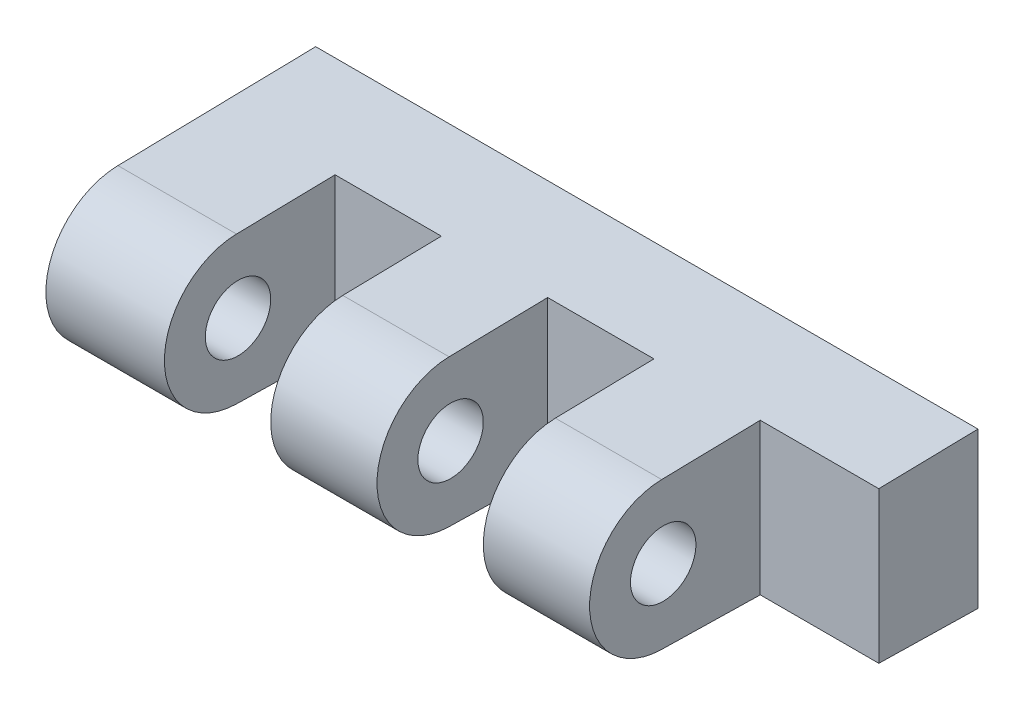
ISO-10303-21;
HEADER;
FILE_DESCRIPTION(('STEP AP214'),'2;1');
FILE_NAME('part.step','',(''),(''),'','','');
FILE_SCHEMA(('AUTOMOTIVE_DESIGN { 1 0 10303 214 1 1 1 1 }'));
ENDSEC;
DATA;
#1=APPLICATION_CONTEXT('core data for automotive mechanical design processes');
#2=APPLICATION_PROTOCOL_DEFINITION('international standard','automotive_design',2000,#1);
#3=PRODUCT_CONTEXT('',#1,'mechanical');
#4=PRODUCT('Part','Part','',(#3));
#5=PRODUCT_RELATED_PRODUCT_CATEGORY('part','',(#4));
#6=PRODUCT_DEFINITION_FORMATION('','',#4);
#7=PRODUCT_DEFINITION_CONTEXT('part definition',#1,'design');
#8=PRODUCT_DEFINITION('design','',#6,#7);
#9=PRODUCT_DEFINITION_SHAPE('','',#8);
#10=(LENGTH_UNIT() NAMED_UNIT(*) SI_UNIT(.MILLI.,.METRE.));
#11=(NAMED_UNIT(*) PLANE_ANGLE_UNIT() SI_UNIT($,.RADIAN.));
#12=(NAMED_UNIT(*) SI_UNIT($,.STERADIAN.) SOLID_ANGLE_UNIT());
#13=UNCERTAINTY_MEASURE_WITH_UNIT(LENGTH_MEASURE(1.E-05),#10,'distance_accuracy_value','');
#14=(GEOMETRIC_REPRESENTATION_CONTEXT(3) GLOBAL_UNCERTAINTY_ASSIGNED_CONTEXT((#13)) GLOBAL_UNIT_ASSIGNED_CONTEXT((#10,
#11,#12)) REPRESENTATION_CONTEXT('',''));
#15=CARTESIAN_POINT('',(0.,0.,0.));
#16=DIRECTION('',(0.,0.,1.));
#17=DIRECTION('',(1.,0.,0.));
#18=AXIS2_PLACEMENT_3D('',#15,#16,#17);
#19=CARTESIAN_POINT('',(30.25,0.,12.));
#20=DIRECTION('',(-1.,0.,0.));
#21=DIRECTION('',(0.,0.,1.));
#22=AXIS2_PLACEMENT_3D('',#19,#20,#21);
#23=CYLINDRICAL_SURFACE('',#22,4.5);
#24=DIRECTION('',(-1.,0.,0.));
#25=VECTOR('',#24,1.);
#26=CARTESIAN_POINT('',(30.25,-4.49903130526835,12.0933665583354));
#27=LINE('',#26,#25);
#28=CARTESIAN_POINT('',(-3.,-4.49903130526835,12.0933665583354));
#29=VERTEX_POINT('',#28);
#30=CARTESIAN_POINT('',(-10.25,-4.49903130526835,12.0933665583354));
#31=VERTEX_POINT('',#30);
#32=EDGE_CURVE('E229',#29,#31,#27,.T.);
#33=ORIENTED_EDGE('',*,*,#32,.F.);
#34=CARTESIAN_POINT('',(-3.,0.,12.));
#35=DIRECTION('',(-1.,0.,0.));
#36=DIRECTION('',(0.,0.,1.));
#37=AXIS2_PLACEMENT_3D('',#34,#35,#36);
#38=CIRCLE('',#37,4.5);
#39=CARTESIAN_POINT('',(-3.,4.49903130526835,12.0933665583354));
#40=VERTEX_POINT('',#39);
#41=EDGE_CURVE('E180',#29,#40,#38,.T.);
#42=ORIENTED_EDGE('',*,*,#41,.T.);
#43=DIRECTION('',(-1.,0.,0.));
#44=VECTOR('',#43,1.);
#45=CARTESIAN_POINT('',(30.25,4.49903130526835,12.0933665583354));
#46=LINE('',#45,#44);
#47=CARTESIAN_POINT('',(-10.25,4.49903130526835,12.0933665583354));
#48=VERTEX_POINT('',#47);
#49=EDGE_CURVE('E233',#40,#48,#46,.T.);
#50=ORIENTED_EDGE('',*,*,#49,.T.);
#51=CARTESIAN_POINT('',(-10.25,0.,12.));
#52=DIRECTION('',(1.,0.,0.));
#53=DIRECTION('',(0.,0.,-1.));
#54=AXIS2_PLACEMENT_3D('',#51,#52,#53);
#55=CIRCLE('',#54,4.5);
#56=EDGE_CURVE('E218',#48,#31,#55,.T.);
#57=ORIENTED_EDGE('',*,*,#56,.T.);
#58=EDGE_LOOP('',(#33,#42,#50,#57));
#59=FACE_BOUND('',#58,.T.);
#60=ADVANCED_FACE('F14',(#59),#23,.T.);
#61=CARTESIAN_POINT('',(10.,4.49903130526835,12.0933665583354));
#62=VERTEX_POINT('',#61);
#63=CARTESIAN_POINT('',(3.5,4.49903130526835,12.0933665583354));
#64=VERTEX_POINT('',#63);
#65=EDGE_CURVE('E235',#62,#64,#46,.T.);
#66=ORIENTED_EDGE('',*,*,#65,.T.);
#67=CARTESIAN_POINT('',(3.5,0.,12.));
#68=DIRECTION('',(1.,0.,0.));
#69=DIRECTION('',(0.,0.,-1.));
#70=AXIS2_PLACEMENT_3D('',#67,#68,#69);
#71=CIRCLE('',#70,4.5);
#72=CARTESIAN_POINT('',(3.5,-4.49903130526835,12.0933665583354));
#73=VERTEX_POINT('',#72);
#74=EDGE_CURVE('E170',#64,#73,#71,.T.);
#75=ORIENTED_EDGE('',*,*,#74,.T.);
#76=CARTESIAN_POINT('',(10.,-4.49903130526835,12.0933665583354));
#77=VERTEX_POINT('',#76);
#78=EDGE_CURVE('E231',#77,#73,#27,.T.);
#79=ORIENTED_EDGE('',*,*,#78,.F.);
#80=CARTESIAN_POINT('',(10.,0.,12.));
#81=DIRECTION('',(-1.,0.,0.));
#82=DIRECTION('',(0.,0.,1.));
#83=AXIS2_PLACEMENT_3D('',#80,#81,#82);
#84=CIRCLE('',#83,4.5);
#85=EDGE_CURVE('E160',#77,#62,#84,.T.);
#86=ORIENTED_EDGE('',*,*,#85,.T.);
#87=EDGE_LOOP('',(#66,#75,#79,#86));
#88=FACE_BOUND('',#87,.T.);
#89=ADVANCED_FACE('F269',(#88),#23,.T.);
#90=CARTESIAN_POINT('',(30.25,0.,12.));
#91=DIRECTION('',(-1.,0.,0.));
#92=DIRECTION('',(0.,0.,1.));
#93=AXIS2_PLACEMENT_3D('',#90,#91,#92);
#94=CYLINDRICAL_SURFACE('',#93,2.);
#95=CARTESIAN_POINT('',(-3.,0.,12.));
#96=DIRECTION('',(-1.,0.,0.));
#97=DIRECTION('',(0.,0.,1.));
#98=AXIS2_PLACEMENT_3D('',#95,#96,#97);
#99=CIRCLE('',#98,2.);
#100=CARTESIAN_POINT('',(-3.,0.,14.));
#101=VERTEX_POINT('',#100);
#102=EDGE_CURVE('E176',#101,#101,#99,.T.);
#103=ORIENTED_EDGE('',*,*,#102,.F.);
#104=EDGE_LOOP('',(#103));
#105=FACE_BOUND('',#104,.T.);
#106=CARTESIAN_POINT('',(-10.25,0.,12.));
#107=DIRECTION('',(1.,0.,0.));
#108=DIRECTION('',(0.,0.,-1.));
#109=AXIS2_PLACEMENT_3D('',#106,#107,#108);
#110=CIRCLE('',#109,2.);
#111=CARTESIAN_POINT('',(-10.25,0.,10.));
#112=VERTEX_POINT('',#111);
#113=EDGE_CURVE('E196',#112,#112,#110,.T.);
#114=ORIENTED_EDGE('',*,*,#113,.F.);
#115=EDGE_LOOP('',(#114));
#116=FACE_BOUND('',#115,.T.);
#117=ADVANCED_FACE('F295',(#105,#116),#94,.F.);
#118=CARTESIAN_POINT('',(30.25,0.,12.));
#119=DIRECTION('',(1.,0.,0.));
#120=DIRECTION('',(0.,0.,-1.));
#121=AXIS2_PLACEMENT_3D('',#118,#119,#120);
#122=PLANE('',#121);
#123=DIRECTION('',(0.,1.,0.));
#124=VECTOR('',#123,1.);
#125=CARTESIAN_POINT('',(30.25,0.,6.06549880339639));
#126=LINE('',#125,#124);
#127=CARTESIAN_POINT('',(30.25,-4.62412518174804,6.06549880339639));
#128=VERTEX_POINT('',#127);
#129=CARTESIAN_POINT('',(30.25,4.62412518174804,6.06549880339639));
#130=VERTEX_POINT('',#129);
#131=EDGE_CURVE('E120',#128,#130,#126,.T.);
#132=ORIENTED_EDGE('',*,*,#131,.F.);
#133=DIRECTION('',(0.,-0.0207481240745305,-0.999784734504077));
#134=VECTOR('',#133,1.);
#135=CARTESIAN_POINT('',(30.25,-4.75,0.));
#136=LINE('',#135,#134);
#137=CARTESIAN_POINT('',(30.25,-4.75,0.));
#138=VERTEX_POINT('',#137);
#139=EDGE_CURVE('E210',#128,#138,#136,.T.);
#140=ORIENTED_EDGE('',*,*,#139,.T.);
#141=DIRECTION('',(0.,1.,0.));
#142=VECTOR('',#141,1.);
#143=CARTESIAN_POINT('',(30.25,4.75,0.));
#144=LINE('',#143,#142);
#145=CARTESIAN_POINT('',(30.25,4.75,0.));
#146=VERTEX_POINT('',#145);
#147=EDGE_CURVE('E213',#138,#146,#144,.T.);
#148=ORIENTED_EDGE('',*,*,#147,.T.);
#149=DIRECTION('',(0.,-0.0207481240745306,0.999784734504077));
#150=VECTOR('',#149,1.);
#151=CARTESIAN_POINT('',(30.25,4.75,0.));
#152=LINE('',#151,#150);
#153=EDGE_CURVE('E208',#146,#130,#152,.T.);
#154=ORIENTED_EDGE('',*,*,#153,.T.);
#155=EDGE_LOOP('',(#132,#140,#148,#154));
#156=FACE_BOUND('',#155,.T.);
#157=ADVANCED_FACE('F293',(#156),#122,.T.);
#158=CARTESIAN_POINT('',(-10.25,0.,12.));
#159=DIRECTION('',(1.,0.,0.));
#160=DIRECTION('',(0.,0.,-1.));
#161=AXIS2_PLACEMENT_3D('',#158,#159,#160);
#162=PLANE('',#161);
#163=DIRECTION('',(0.,-0.0207481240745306,0.999784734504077));
#164=VECTOR('',#163,1.);
#165=CARTESIAN_POINT('',(-10.25,4.75,0.));
#166=LINE('',#165,#164);
#167=CARTESIAN_POINT('',(-10.25,4.75,0.));
#168=VERTEX_POINT('',#167);
#169=EDGE_CURVE('E207',#168,#48,#166,.T.);
#170=ORIENTED_EDGE('',*,*,#169,.F.);
#171=DIRECTION('',(0.,1.,0.));
#172=VECTOR('',#171,1.);
#173=CARTESIAN_POINT('',(-10.25,4.75,0.));
#174=LINE('',#173,#172);
#175=CARTESIAN_POINT('',(-10.25,-4.75,0.));
#176=VERTEX_POINT('',#175);
#177=EDGE_CURVE('E211',#176,#168,#174,.T.);
#178=ORIENTED_EDGE('',*,*,#177,.F.);
#179=DIRECTION('',(0.,-0.0207481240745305,-0.999784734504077));
#180=VECTOR('',#179,1.);
#181=CARTESIAN_POINT('',(-10.25,-4.75,0.));
#182=LINE('',#181,#180);
#183=EDGE_CURVE('E221',#31,#176,#182,.T.);
#184=ORIENTED_EDGE('',*,*,#183,.F.);
#185=ORIENTED_EDGE('',*,*,#56,.F.);
#186=EDGE_LOOP('',(#170,#178,#184,#185));
#187=FACE_BOUND('',#186,.T.);
#188=ORIENTED_EDGE('',*,*,#113,.T.);
#189=EDGE_LOOP('',(#188));
#190=FACE_BOUND('',#189,.T.);
#191=ADVANCED_FACE('F285',(#187,#190),#162,.F.);
#192=CARTESIAN_POINT('',(30.25,4.75,0.));
#193=DIRECTION('',(0.,-0.999784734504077,-0.0207481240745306));
#194=DIRECTION('',(0.,0.0207481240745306,-0.999784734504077));
#195=AXIS2_PLACEMENT_3D('',#192,#193,#194);
#196=PLANE('',#195);
#197=ORIENTED_EDGE('',*,*,#49,.F.);
#198=DIRECTION('',(0.,0.0207481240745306,-0.999784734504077));
#199=VECTOR('',#198,1.);
#200=CARTESIAN_POINT('',(-3.,4.75,0.));
#201=LINE('',#200,#199);
#202=CARTESIAN_POINT('',(-3.,4.62412518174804,6.06549880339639));
#203=VERTEX_POINT('',#202);
#204=EDGE_CURVE('E183',#40,#203,#201,.T.);
#205=ORIENTED_EDGE('',*,*,#204,.T.);
#206=DIRECTION('',(1.,0.,0.));
#207=VECTOR('',#206,1.);
#208=CARTESIAN_POINT('',(30.25,4.62412518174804,6.06549880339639));
#209=LINE('',#208,#207);
#210=CARTESIAN_POINT('',(3.5,4.62412518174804,6.06549880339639));
#211=VERTEX_POINT('',#210);
#212=EDGE_CURVE('E189',#203,#211,#209,.T.);
#213=ORIENTED_EDGE('',*,*,#212,.T.);
#214=DIRECTION('',(0.,-0.0207481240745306,0.999784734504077));
#215=VECTOR('',#214,1.);
#216=CARTESIAN_POINT('',(3.5,4.75,0.));
#217=LINE('',#216,#215);
#218=EDGE_CURVE('E173',#211,#64,#217,.T.);
#219=ORIENTED_EDGE('',*,*,#218,.T.);
#220=ORIENTED_EDGE('',*,*,#65,.F.);
#221=DIRECTION('',(0.,0.0207481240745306,-0.999784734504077));
#222=VECTOR('',#221,1.);
#223=CARTESIAN_POINT('',(10.,4.75,0.));
#224=LINE('',#223,#222);
#225=CARTESIAN_POINT('',(10.,4.62412518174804,6.06549880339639));
#226=VERTEX_POINT('',#225);
#227=EDGE_CURVE('E163',#62,#226,#224,.T.);
#228=ORIENTED_EDGE('',*,*,#227,.T.);
#229=DIRECTION('',(1.,0.,0.));
#230=VECTOR('',#229,1.);
#231=CARTESIAN_POINT('',(30.25,4.62412518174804,6.06549880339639));
#232=LINE('',#231,#230);
#233=CARTESIAN_POINT('',(16.5,4.62412518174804,6.06549880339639));
#234=VERTEX_POINT('',#233);
#235=EDGE_CURVE('E125',#226,#234,#232,.T.);
#236=ORIENTED_EDGE('',*,*,#235,.T.);
#237=DIRECTION('',(0.,-0.0207481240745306,0.999784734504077));
#238=VECTOR('',#237,1.);
#239=CARTESIAN_POINT('',(16.5,4.75,0.));
#240=LINE('',#239,#238);
#241=CARTESIAN_POINT('',(16.5,4.49903130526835,12.0933665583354));
#242=VERTEX_POINT('',#241);
#243=EDGE_CURVE('E154',#234,#242,#240,.T.);
#244=ORIENTED_EDGE('',*,*,#243,.T.);
#245=CARTESIAN_POINT('',(23.,4.49903130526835,12.0933665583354));
#246=VERTEX_POINT('',#245);
#247=EDGE_CURVE('E139',#246,#242,#46,.T.);
#248=ORIENTED_EDGE('',*,*,#247,.F.);
#249=DIRECTION('',(0.,0.0207481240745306,-0.999784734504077));
#250=VECTOR('',#249,1.);
#251=CARTESIAN_POINT('',(23.,4.75,0.));
#252=LINE('',#251,#250);
#253=CARTESIAN_POINT('',(23.,4.62412518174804,6.06549880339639));
#254=VERTEX_POINT('',#253);
#255=EDGE_CURVE('E129',#246,#254,#252,.T.);
#256=ORIENTED_EDGE('',*,*,#255,.T.);
#257=DIRECTION('',(1.,0.,0.));
#258=VECTOR('',#257,1.);
#259=CARTESIAN_POINT('',(30.25,4.62412518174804,6.06549880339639));
#260=LINE('',#259,#258);
#261=EDGE_CURVE('E114',#254,#130,#260,.T.);
#262=ORIENTED_EDGE('',*,*,#261,.T.);
#263=ORIENTED_EDGE('',*,*,#153,.F.);
#264=DIRECTION('',(-1.,0.,0.));
#265=VECTOR('',#264,1.);
#266=CARTESIAN_POINT('',(30.25,4.75,0.));
#267=LINE('',#266,#265);
#268=EDGE_CURVE('E215',#146,#168,#267,.T.);
#269=ORIENTED_EDGE('',*,*,#268,.T.);
#270=ORIENTED_EDGE('',*,*,#169,.T.);
#271=EDGE_LOOP('',(#197,#205,#213,#219,#220,#228,#236,#244,#248,#256,#262,#263,#269,#270));
#272=FACE_BOUND('',#271,.T.);
#273=ADVANCED_FACE('F16',(#272),#196,.F.);
#274=ORIENTED_EDGE('',*,*,#247,.T.);
#275=CARTESIAN_POINT('',(16.5,0.,12.));
#276=DIRECTION('',(1.,0.,0.));
#277=DIRECTION('',(0.,0.,-1.));
#278=AXIS2_PLACEMENT_3D('',#275,#276,#277);
#279=CIRCLE('',#278,4.5);
#280=CARTESIAN_POINT('',(16.5,-4.49903130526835,12.0933665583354));
#281=VERTEX_POINT('',#280);
#282=EDGE_CURVE('E151',#242,#281,#279,.T.);
#283=ORIENTED_EDGE('',*,*,#282,.T.);
#284=CARTESIAN_POINT('',(23.,-4.49903130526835,12.0933665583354));
#285=VERTEX_POINT('',#284);
#286=EDGE_CURVE('E232',#285,#281,#27,.T.);
#287=ORIENTED_EDGE('',*,*,#286,.F.);
#288=CARTESIAN_POINT('',(23.,0.,12.));
#289=DIRECTION('',(-1.,0.,0.));
#290=DIRECTION('',(0.,0.,1.));
#291=AXIS2_PLACEMENT_3D('',#288,#289,#290);
#292=CIRCLE('',#291,4.5);
#293=EDGE_CURVE('E141',#285,#246,#292,.T.);
#294=ORIENTED_EDGE('',*,*,#293,.T.);
#295=EDGE_LOOP('',(#274,#283,#287,#294));
#296=FACE_BOUND('',#295,.T.);
#297=ADVANCED_FACE('F266',(#296),#23,.T.);
#298=CARTESIAN_POINT('',(30.25,-4.75,0.));
#299=DIRECTION('',(0.,0.999784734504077,-0.0207481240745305));
#300=DIRECTION('',(0.,0.0207481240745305,0.999784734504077));
#301=AXIS2_PLACEMENT_3D('',#298,#299,#300);
#302=PLANE('',#301);
#303=DIRECTION('',(-1.,0.,0.));
#304=VECTOR('',#303,1.);
#305=CARTESIAN_POINT('',(30.25,-4.62412518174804,6.06549880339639));
#306=LINE('',#305,#304);
#307=CARTESIAN_POINT('',(3.5,-4.62412518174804,6.06549880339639));
#308=VERTEX_POINT('',#307);
#309=CARTESIAN_POINT('',(-3.,-4.62412518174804,6.06549880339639));
#310=VERTEX_POINT('',#309);
#311=EDGE_CURVE('E9',#308,#310,#306,.T.);
#312=ORIENTED_EDGE('',*,*,#311,.T.);
#313=DIRECTION('',(0.,0.0207481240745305,0.999784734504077));
#314=VECTOR('',#313,1.);
#315=CARTESIAN_POINT('',(-3.,-4.75,0.));
#316=LINE('',#315,#314);
#317=EDGE_CURVE('E177',#310,#29,#316,.T.);
#318=ORIENTED_EDGE('',*,*,#317,.T.);
#319=ORIENTED_EDGE('',*,*,#32,.T.);
#320=ORIENTED_EDGE('',*,*,#183,.T.);
#321=DIRECTION('',(-1.,0.,0.));
#322=VECTOR('',#321,1.);
#323=CARTESIAN_POINT('',(30.25,-4.75,0.));
#324=LINE('',#323,#322);
#325=EDGE_CURVE('E226',#138,#176,#324,.T.);
#326=ORIENTED_EDGE('',*,*,#325,.F.);
#327=ORIENTED_EDGE('',*,*,#139,.F.);
#328=DIRECTION('',(-1.,0.,0.));
#329=VECTOR('',#328,1.);
#330=CARTESIAN_POINT('',(30.25,-4.62412518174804,6.06549880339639));
#331=LINE('',#330,#329);
#332=CARTESIAN_POINT('',(23.,-4.62412518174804,6.06549880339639));
#333=VERTEX_POINT('',#332);
#334=EDGE_CURVE('E246',#128,#333,#331,.T.);
#335=ORIENTED_EDGE('',*,*,#334,.T.);
#336=DIRECTION('',(0.,0.0207481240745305,0.999784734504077));
#337=VECTOR('',#336,1.);
#338=CARTESIAN_POINT('',(23.,-4.75,0.));
#339=LINE('',#338,#337);
#340=EDGE_CURVE('E132',#333,#285,#339,.T.);
#341=ORIENTED_EDGE('',*,*,#340,.T.);
#342=ORIENTED_EDGE('',*,*,#286,.T.);
#343=DIRECTION('',(0.,-0.0207481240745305,-0.999784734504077));
#344=VECTOR('',#343,1.);
#345=CARTESIAN_POINT('',(16.5,-4.75,0.));
#346=LINE('',#345,#344);
#347=CARTESIAN_POINT('',(16.5,-4.62412518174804,6.06549880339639));
#348=VERTEX_POINT('',#347);
#349=EDGE_CURVE('E144',#281,#348,#346,.T.);
#350=ORIENTED_EDGE('',*,*,#349,.T.);
#351=DIRECTION('',(-1.,0.,0.));
#352=VECTOR('',#351,1.);
#353=CARTESIAN_POINT('',(30.25,-4.62412518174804,6.06549880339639));
#354=LINE('',#353,#352);
#355=CARTESIAN_POINT('',(10.,-4.62412518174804,6.06549880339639));
#356=VERTEX_POINT('',#355);
#357=EDGE_CURVE('E22',#348,#356,#354,.T.);
#358=ORIENTED_EDGE('',*,*,#357,.T.);
#359=DIRECTION('',(0.,0.0207481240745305,0.999784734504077));
#360=VECTOR('',#359,1.);
#361=CARTESIAN_POINT('',(10.,-4.75,0.));
#362=LINE('',#361,#360);
#363=EDGE_CURVE('E157',#356,#77,#362,.T.);
#364=ORIENTED_EDGE('',*,*,#363,.T.);
#365=ORIENTED_EDGE('',*,*,#78,.T.);
#366=DIRECTION('',(0.,-0.0207481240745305,-0.999784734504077));
#367=VECTOR('',#366,1.);
#368=CARTESIAN_POINT('',(3.5,-4.75,0.));
#369=LINE('',#368,#367);
#370=EDGE_CURVE('E167',#73,#308,#369,.T.);
#371=ORIENTED_EDGE('',*,*,#370,.T.);
#372=EDGE_LOOP('',(#312,#318,#319,#320,#326,#327,#335,#341,#342,#350,#358,#364,#365,#371));
#373=FACE_BOUND('',#372,.T.);
#374=ADVANCED_FACE('F249',(#373),#302,.F.);
#375=CARTESIAN_POINT('',(30.25,4.75,0.));
#376=DIRECTION('',(0.,0.,1.));
#377=DIRECTION('',(0.,-1.,0.));
#378=AXIS2_PLACEMENT_3D('',#375,#376,#377);
#379=PLANE('',#378);
#380=CARTESIAN_POINT('',(20.,0.,0.));
#381=DIRECTION('',(0.,0.,-1.));
#382=DIRECTION('',(0.,1.,0.));
#383=AXIS2_PLACEMENT_3D('',#380,#381,#382);
#384=CIRCLE('',#383,2.);
#385=CARTESIAN_POINT('',(20.,2.,0.));
#386=VERTEX_POINT('',#385);
#387=EDGE_CURVE('E197',#386,#386,#384,.T.);
#388=ORIENTED_EDGE('',*,*,#387,.F.);
#389=EDGE_LOOP('',(#388));
#390=FACE_BOUND('',#389,.T.);
#391=CARTESIAN_POINT('',(0.,0.,0.));
#392=DIRECTION('',(0.,0.,-1.));
#393=DIRECTION('',(0.,1.,0.));
#394=AXIS2_PLACEMENT_3D('',#391,#392,#393);
#395=CIRCLE('',#394,2.);
#396=CARTESIAN_POINT('',(0.,2.,0.));
#397=VERTEX_POINT('',#396);
#398=EDGE_CURVE('E192',#397,#397,#395,.T.);
#399=ORIENTED_EDGE('',*,*,#398,.F.);
#400=EDGE_LOOP('',(#399));
#401=FACE_BOUND('',#400,.T.);
#402=ORIENTED_EDGE('',*,*,#177,.T.);
#403=ORIENTED_EDGE('',*,*,#268,.F.);
#404=ORIENTED_EDGE('',*,*,#147,.F.);
#405=ORIENTED_EDGE('',*,*,#325,.T.);
#406=EDGE_LOOP('',(#402,#403,#404,#405));
#407=FACE_BOUND('',#406,.T.);
#408=ADVANCED_FACE('F290',(#390,#401,#407),#379,.F.);
#409=CARTESIAN_POINT('',(0.,0.,5.5));
#410=DIRECTION('',(0.,0.,-1.));
#411=DIRECTION('',(0.,1.,0.));
#412=AXIS2_PLACEMENT_3D('',#409,#410,#411);
#413=CYLINDRICAL_SURFACE('',#412,2.);
#414=CARTESIAN_POINT('',(0.,0.,5.5));
#415=DIRECTION('',(0.,0.,-1.));
#416=DIRECTION('',(0.,1.,0.));
#417=AXIS2_PLACEMENT_3D('',#414,#415,#416);
#418=CIRCLE('',#417,2.);
#419=CARTESIAN_POINT('',(0.,2.,5.5));
#420=VERTEX_POINT('',#419);
#421=EDGE_CURVE('E200',#420,#420,#418,.T.);
#422=ORIENTED_EDGE('',*,*,#421,.F.);
#423=EDGE_LOOP('',(#422));
#424=FACE_BOUND('',#423,.T.);
#425=ORIENTED_EDGE('',*,*,#398,.T.);
#426=EDGE_LOOP('',(#425));
#427=FACE_BOUND('',#426,.T.);
#428=ADVANCED_FACE('F369',(#424,#427),#413,.F.);
#429=CARTESIAN_POINT('',(0.,0.,5.5));
#430=DIRECTION('',(0.,0.,-1.));
#431=DIRECTION('',(0.,1.,0.));
#432=AXIS2_PLACEMENT_3D('',#429,#430,#431);
#433=PLANE('',#432);
#434=ORIENTED_EDGE('',*,*,#421,.T.);
#435=EDGE_LOOP('',(#434));
#436=FACE_BOUND('',#435,.T.);
#437=ADVANCED_FACE('F377',(#436),#433,.T.);
#438=CARTESIAN_POINT('',(20.,0.,5.5));
#439=DIRECTION('',(0.,0.,-1.));
#440=DIRECTION('',(0.,1.,0.));
#441=AXIS2_PLACEMENT_3D('',#438,#439,#440);
#442=CYLINDRICAL_SURFACE('',#441,2.);
#443=CARTESIAN_POINT('',(20.,0.,5.5));
#444=DIRECTION('',(0.,0.,-1.));
#445=DIRECTION('',(0.,1.,0.));
#446=AXIS2_PLACEMENT_3D('',#443,#444,#445);
#447=CIRCLE('',#446,2.);
#448=CARTESIAN_POINT('',(20.,2.,5.5));
#449=VERTEX_POINT('',#448);
#450=EDGE_CURVE('E193',#449,#449,#447,.T.);
#451=ORIENTED_EDGE('',*,*,#450,.F.);
#452=EDGE_LOOP('',(#451));
#453=FACE_BOUND('',#452,.T.);
#454=ORIENTED_EDGE('',*,*,#387,.T.);
#455=EDGE_LOOP('',(#454));
#456=FACE_BOUND('',#455,.T.);
#457=ADVANCED_FACE('F386',(#453,#456),#442,.F.);
#458=CARTESIAN_POINT('',(20.,0.,5.5));
#459=DIRECTION('',(0.,0.,-1.));
#460=DIRECTION('',(0.,1.,0.));
#461=AXIS2_PLACEMENT_3D('',#458,#459,#460);
#462=PLANE('',#461);
#463=ORIENTED_EDGE('',*,*,#450,.T.);
#464=EDGE_LOOP('',(#463));
#465=FACE_BOUND('',#464,.T.);
#466=ADVANCED_FACE('F395',(#465),#462,.T.);
#467=CARTESIAN_POINT('',(23.,-7.75,18.8364288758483));
#468=DIRECTION('',(-1.,0.,0.));
#469=DIRECTION('',(0.,0.,1.));
#470=AXIS2_PLACEMENT_3D('',#467,#468,#469);
#471=PLANE('',#470);
#472=CARTESIAN_POINT('',(23.,0.,12.));
#473=DIRECTION('',(-1.,0.,0.));
#474=DIRECTION('',(0.,0.,1.));
#475=AXIS2_PLACEMENT_3D('',#472,#473,#474);
#476=CIRCLE('',#475,2.);
#477=CARTESIAN_POINT('',(23.,0.,14.));
#478=VERTEX_POINT('',#477);
#479=EDGE_CURVE('E236',#478,#478,#476,.T.);
#480=ORIENTED_EDGE('',*,*,#479,.T.);
#481=EDGE_LOOP('',(#480));
#482=FACE_BOUND('',#481,.T.);
#483=ORIENTED_EDGE('',*,*,#293,.F.);
#484=ORIENTED_EDGE('',*,*,#340,.F.);
#485=DIRECTION('',(0.,1.,0.));
#486=VECTOR('',#485,1.);
#487=CARTESIAN_POINT('',(23.,-7.75,6.06549880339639));
#488=LINE('',#487,#486);
#489=EDGE_CURVE('E117',#333,#254,#488,.T.);
#490=ORIENTED_EDGE('',*,*,#489,.T.);
#491=ORIENTED_EDGE('',*,*,#255,.F.);
#492=EDGE_LOOP('',(#483,#484,#490,#491));
#493=FACE_BOUND('',#492,.T.);
#494=ADVANCED_FACE('F128',(#482,#493),#471,.F.);
#495=CARTESIAN_POINT('',(23.,-7.75,6.06549880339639));
#496=DIRECTION('',(0.,0.,-1.));
#497=DIRECTION('',(-1.,0.,0.));
#498=AXIS2_PLACEMENT_3D('',#495,#496,#497);
#499=PLANE('',#498);
#500=ORIENTED_EDGE('',*,*,#489,.F.);
#501=ORIENTED_EDGE('',*,*,#334,.F.);
#502=ORIENTED_EDGE('',*,*,#131,.T.);
#503=ORIENTED_EDGE('',*,*,#261,.F.);
#504=EDGE_LOOP('',(#500,#501,#502,#503));
#505=FACE_BOUND('',#504,.T.);
#506=ADVANCED_FACE('F116',(#505),#499,.F.);
#507=CARTESIAN_POINT('',(16.5,-7.75,6.06549880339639));
#508=DIRECTION('',(1.,0.,0.));
#509=DIRECTION('',(0.,0.,-1.));
#510=AXIS2_PLACEMENT_3D('',#507,#508,#509);
#511=PLANE('',#510);
#512=CARTESIAN_POINT('',(16.5,0.,12.));
#513=DIRECTION('',(1.,0.,0.));
#514=DIRECTION('',(0.,0.,-1.));
#515=AXIS2_PLACEMENT_3D('',#512,#513,#514);
#516=CIRCLE('',#515,2.);
#517=CARTESIAN_POINT('',(16.5,0.,10.));
#518=VERTEX_POINT('',#517);
#519=EDGE_CURVE('E140',#518,#518,#516,.T.);
#520=ORIENTED_EDGE('',*,*,#519,.T.);
#521=EDGE_LOOP('',(#520));
#522=FACE_BOUND('',#521,.T.);
#523=DIRECTION('',(0.,1.,0.));
#524=VECTOR('',#523,1.);
#525=CARTESIAN_POINT('',(16.5,-7.75,6.06549880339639));
#526=LINE('',#525,#524);
#527=EDGE_CURVE('E37',#348,#234,#526,.T.);
#528=ORIENTED_EDGE('',*,*,#527,.F.);
#529=ORIENTED_EDGE('',*,*,#349,.F.);
#530=ORIENTED_EDGE('',*,*,#282,.F.);
#531=ORIENTED_EDGE('',*,*,#243,.F.);
#532=EDGE_LOOP('',(#528,#529,#530,#531));
#533=FACE_BOUND('',#532,.T.);
#534=ADVANCED_FACE('F420',(#522,#533),#511,.F.);
#535=CARTESIAN_POINT('',(10.,-7.75,6.06549880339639));
#536=DIRECTION('',(-1.,0.,0.));
#537=DIRECTION('',(0.,0.,1.));
#538=AXIS2_PLACEMENT_3D('',#535,#536,#537);
#539=PLANE('',#538);
#540=CARTESIAN_POINT('',(10.,0.,12.));
#541=DIRECTION('',(-1.,0.,0.));
#542=DIRECTION('',(0.,0.,1.));
#543=AXIS2_PLACEMENT_3D('',#540,#541,#542);
#544=CIRCLE('',#543,2.);
#545=CARTESIAN_POINT('',(10.,0.,14.));
#546=VERTEX_POINT('',#545);
#547=EDGE_CURVE('E156',#546,#546,#544,.T.);
#548=ORIENTED_EDGE('',*,*,#547,.T.);
#549=EDGE_LOOP('',(#548));
#550=FACE_BOUND('',#549,.T.);
#551=ORIENTED_EDGE('',*,*,#85,.F.);
#552=ORIENTED_EDGE('',*,*,#363,.F.);
#553=DIRECTION('',(0.,1.,0.));
#554=VECTOR('',#553,1.);
#555=CARTESIAN_POINT('',(10.,-7.75,6.06549880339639));
#556=LINE('',#555,#554);
#557=EDGE_CURVE('E257',#356,#226,#556,.T.);
#558=ORIENTED_EDGE('',*,*,#557,.T.);
#559=ORIENTED_EDGE('',*,*,#227,.F.);
#560=EDGE_LOOP('',(#551,#552,#558,#559));
#561=FACE_BOUND('',#560,.T.);
#562=ADVANCED_FACE('F428',(#550,#561),#539,.F.);
#563=CARTESIAN_POINT('',(10.,-7.75,6.06549880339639));
#564=DIRECTION('',(0.,0.,-1.));
#565=DIRECTION('',(-1.,0.,0.));
#566=AXIS2_PLACEMENT_3D('',#563,#564,#565);
#567=PLANE('',#566);
#568=ORIENTED_EDGE('',*,*,#557,.F.);
#569=ORIENTED_EDGE('',*,*,#357,.F.);
#570=ORIENTED_EDGE('',*,*,#527,.T.);
#571=ORIENTED_EDGE('',*,*,#235,.F.);
#572=EDGE_LOOP('',(#568,#569,#570,#571));
#573=FACE_BOUND('',#572,.T.);
#574=ADVANCED_FACE('F255',(#573),#567,.F.);
#575=CARTESIAN_POINT('',(3.5,0.,12.));
#576=DIRECTION('',(1.,0.,0.));
#577=DIRECTION('',(0.,0.,-1.));
#578=AXIS2_PLACEMENT_3D('',#575,#576,#577);
#579=CIRCLE('',#578,2.);
#580=CARTESIAN_POINT('',(3.5,0.,10.));
#581=VERTEX_POINT('',#580);
#582=EDGE_CURVE('E166',#581,#581,#579,.T.);
#583=ORIENTED_EDGE('',*,*,#582,.F.);
#584=EDGE_LOOP('',(#583));
#585=FACE_BOUND('',#584,.T.);
#586=ORIENTED_EDGE('',*,*,#547,.F.);
#587=EDGE_LOOP('',(#586));
#588=FACE_BOUND('',#587,.T.);
#589=ADVANCED_FACE('F306',(#585,#588),#94,.F.);
#590=CARTESIAN_POINT('',(-3.,-7.75,6.06549880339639));
#591=DIRECTION('',(0.,0.,-1.));
#592=DIRECTION('',(-1.,0.,0.));
#593=AXIS2_PLACEMENT_3D('',#590,#591,#592);
#594=PLANE('',#593);
#595=DIRECTION('',(0.,1.,0.));
#596=VECTOR('',#595,1.);
#597=CARTESIAN_POINT('',(-3.,-7.75,6.06549880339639));
#598=LINE('',#597,#596);
#599=EDGE_CURVE('E238',#310,#203,#598,.T.);
#600=ORIENTED_EDGE('',*,*,#599,.F.);
#601=ORIENTED_EDGE('',*,*,#311,.F.);
#602=DIRECTION('',(0.,1.,0.));
#603=VECTOR('',#602,1.);
#604=CARTESIAN_POINT('',(3.5,-7.75,6.06549880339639));
#605=LINE('',#604,#603);
#606=EDGE_CURVE('E29',#308,#211,#605,.T.);
#607=ORIENTED_EDGE('',*,*,#606,.T.);
#608=ORIENTED_EDGE('',*,*,#212,.F.);
#609=EDGE_LOOP('',(#600,#601,#607,#608));
#610=FACE_BOUND('',#609,.T.);
#611=ADVANCED_FACE('F275',(#610),#594,.F.);
#612=CARTESIAN_POINT('',(-3.,-7.75,22.6004924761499));
#613=DIRECTION('',(-1.,0.,0.));
#614=DIRECTION('',(0.,0.,1.));
#615=AXIS2_PLACEMENT_3D('',#612,#613,#614);
#616=PLANE('',#615);
#617=ORIENTED_EDGE('',*,*,#102,.T.);
#618=EDGE_LOOP('',(#617));
#619=FACE_BOUND('',#618,.T.);
#620=ORIENTED_EDGE('',*,*,#41,.F.);
#621=ORIENTED_EDGE('',*,*,#317,.F.);
#622=ORIENTED_EDGE('',*,*,#599,.T.);
#623=ORIENTED_EDGE('',*,*,#204,.F.);
#624=EDGE_LOOP('',(#620,#621,#622,#623));
#625=FACE_BOUND('',#624,.T.);
#626=ADVANCED_FACE('F277',(#619,#625),#616,.F.);
#627=CARTESIAN_POINT('',(3.5,-7.75,6.06549880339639));
#628=DIRECTION('',(1.,0.,0.));
#629=DIRECTION('',(0.,0.,-1.));
#630=AXIS2_PLACEMENT_3D('',#627,#628,#629);
#631=PLANE('',#630);
#632=ORIENTED_EDGE('',*,*,#582,.T.);
#633=EDGE_LOOP('',(#632));
#634=FACE_BOUND('',#633,.T.);
#635=ORIENTED_EDGE('',*,*,#606,.F.);
#636=ORIENTED_EDGE('',*,*,#370,.F.);
#637=ORIENTED_EDGE('',*,*,#74,.F.);
#638=ORIENTED_EDGE('',*,*,#218,.F.);
#639=EDGE_LOOP('',(#635,#636,#637,#638));
#640=FACE_BOUND('',#639,.T.);
#641=ADVANCED_FACE('F271',(#634,#640),#631,.F.);
#642=ORIENTED_EDGE('',*,*,#519,.F.);
#643=EDGE_LOOP('',(#642));
#644=FACE_BOUND('',#643,.T.);
#645=ORIENTED_EDGE('',*,*,#479,.F.);
#646=EDGE_LOOP('',(#645));
#647=FACE_BOUND('',#646,.T.);
#648=ADVANCED_FACE('F307',(#644,#647),#94,.F.);
#649=CLOSED_SHELL('',(#60,#89,#117,#157,#191,#273,#297,#374,#408,#428,#437,#457,#466,#494,#506,
#534,#562,#574,#589,#611,#626,#641,#648));
#650=MANIFOLD_SOLID_BREP('B1',#649);
#651=ADVANCED_BREP_SHAPE_REPRESENTATION('',(#18,#650),#14);
#652=SHAPE_DEFINITION_REPRESENTATION(#9,#651);
ENDSEC;
END-ISO-10303-21;
